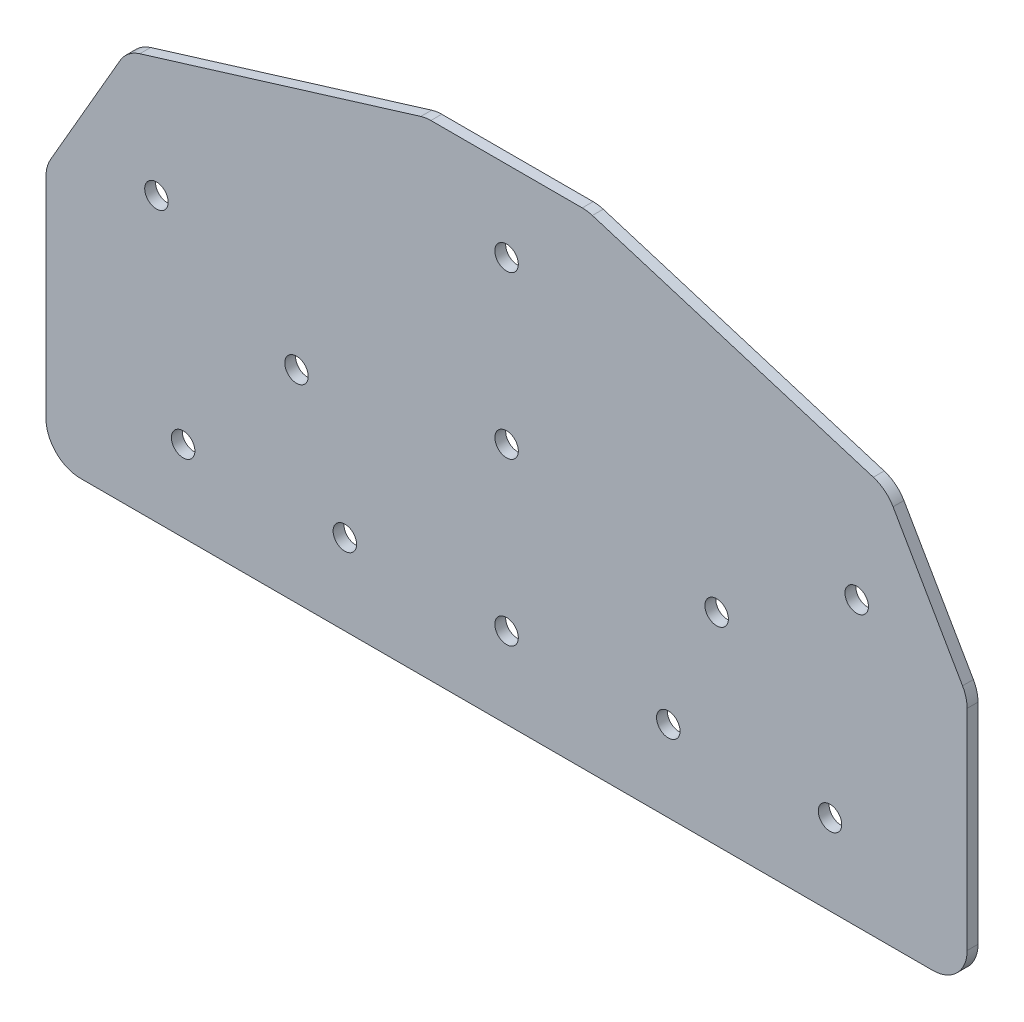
ISO-10303-21;
HEADER;
FILE_DESCRIPTION(('STEP AP214'),'2;1');
FILE_NAME('part.step','',(''),(''),'','','');
FILE_SCHEMA(('AUTOMOTIVE_DESIGN { 1 0 10303 214 1 1 1 1 }'));
ENDSEC;
DATA;
#1=APPLICATION_CONTEXT('core data for automotive mechanical design processes');
#2=APPLICATION_PROTOCOL_DEFINITION('international standard','automotive_design',2000,#1);
#3=PRODUCT_CONTEXT('',#1,'mechanical');
#4=PRODUCT('Part','Part','',(#3));
#5=PRODUCT_RELATED_PRODUCT_CATEGORY('part','',(#4));
#6=PRODUCT_DEFINITION_FORMATION('','',#4);
#7=PRODUCT_DEFINITION_CONTEXT('part definition',#1,'design');
#8=PRODUCT_DEFINITION('design','',#6,#7);
#9=PRODUCT_DEFINITION_SHAPE('','',#8);
#10=(LENGTH_UNIT() NAMED_UNIT(*) SI_UNIT(.MILLI.,.METRE.));
#11=(NAMED_UNIT(*) PLANE_ANGLE_UNIT() SI_UNIT($,.RADIAN.));
#12=(NAMED_UNIT(*) SI_UNIT($,.STERADIAN.) SOLID_ANGLE_UNIT());
#13=UNCERTAINTY_MEASURE_WITH_UNIT(LENGTH_MEASURE(1.E-05),#10,'distance_accuracy_value','');
#14=(GEOMETRIC_REPRESENTATION_CONTEXT(3) GLOBAL_UNCERTAINTY_ASSIGNED_CONTEXT((#13)) GLOBAL_UNIT_ASSIGNED_CONTEXT((#10,
#11,#12)) REPRESENTATION_CONTEXT('',''));
#15=CARTESIAN_POINT('',(0.,0.,0.));
#16=DIRECTION('',(0.,0.,1.));
#17=DIRECTION('',(1.,0.,0.));
#18=AXIS2_PLACEMENT_3D('',#15,#16,#17);
#19=CARTESIAN_POINT('',(56.8325,0.,1.524));
#20=DIRECTION('',(0.,0.,1.));
#21=DIRECTION('',(1.,0.,0.));
#22=AXIS2_PLACEMENT_3D('',#19,#20,#21);
#23=PLANE('',#22);
#24=DIRECTION('',(-1.,0.,0.));
#25=VECTOR('',#24,1.);
#26=CARTESIAN_POINT('',(-56.8325,0.,1.524));
#27=LINE('',#26,#25);
#28=CARTESIAN_POINT('',(-59.9034415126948,0.,1.524));
#29=VERTEX_POINT('',#28);
#30=CARTESIAN_POINT('',(59.9034415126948,0.,1.524));
#31=VERTEX_POINT('',#30);
#32=EDGE_CURVE('E162',#29,#31,#27,.F.);
#33=ORIENTED_EDGE('',*,*,#32,.T.);
#34=CARTESIAN_POINT('',(59.9034415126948,4.841875,1.524));
#35=DIRECTION('',(0.,0.,-1.));
#36=DIRECTION('',(-1.,0.,0.));
#37=AXIS2_PLACEMENT_3D('',#34,#35,#36);
#38=CIRCLE('',#37,4.841875);
#39=CARTESIAN_POINT('',(64.7453165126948,4.841875,1.524));
#40=VERTEX_POINT('',#39);
#41=EDGE_CURVE('E164',#40,#31,#38,.T.);
#42=ORIENTED_EDGE('',*,*,#41,.F.);
#43=DIRECTION('',(0.,1.,0.));
#44=VECTOR('',#43,1.);
#45=CARTESIAN_POINT('',(64.7453165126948,35.6223222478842,1.524));
#46=LINE('',#45,#44);
#47=CARTESIAN_POINT('',(64.7453165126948,34.3249457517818,1.524));
#48=VERTEX_POINT('',#47);
#49=EDGE_CURVE('E158',#48,#40,#46,.F.);
#50=ORIENTED_EDGE('',*,*,#49,.F.);
#51=CARTESIAN_POINT('',(59.9034415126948,34.3249457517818,1.524));
#52=DIRECTION('',(0.,0.,1.));
#53=DIRECTION('',(1.,0.,0.));
#54=AXIS2_PLACEMENT_3D('',#51,#52,#53);
#55=CIRCLE('',#54,4.841875);
#56=CARTESIAN_POINT('',(64.0966282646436,36.7458832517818,1.524));
#57=VERTEX_POINT('',#56);
#58=EDGE_CURVE('E245',#57,#48,#55,.F.);
#59=ORIENTED_EDGE('',*,*,#58,.F.);
#60=DIRECTION('',(0.500000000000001,-0.866025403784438,0.));
#61=VECTOR('',#60,1.);
#62=CARTESIAN_POINT('',(64.7453165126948,35.6223222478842,1.524));
#63=LINE('',#62,#61);
#64=CARTESIAN_POINT('',(54.3310841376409,53.6603018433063,1.524));
#65=VERTEX_POINT('',#64);
#66=EDGE_CURVE('E134',#57,#65,#63,.F.);
#67=ORIENTED_EDGE('',*,*,#66,.T.);
#68=CARTESIAN_POINT('',(50.1378973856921,51.2393643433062,1.524));
#69=DIRECTION('',(0.,0.,-1.));
#70=DIRECTION('',(-1.,0.,0.));
#71=AXIS2_PLACEMENT_3D('',#68,#69,#70);
#72=CIRCLE('',#71,4.841875);
#73=CARTESIAN_POINT('',(51.5580449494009,55.8682880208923,1.524));
#74=VERTEX_POINT('',#73);
#75=EDGE_CURVE('E128',#74,#65,#72,.T.);
#76=ORIENTED_EDGE('',*,*,#75,.F.);
#77=DIRECTION('',(0.956018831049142,-0.293305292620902,0.));
#78=VECTOR('',#77,1.);
#79=CARTESIAN_POINT('',(53.3788165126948,55.3096777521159,1.524));
#80=LINE('',#79,#78);
#81=CARTESIAN_POINT('',(12.0606077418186,67.986048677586,1.524));
#82=VERTEX_POINT('',#81);
#83=EDGE_CURVE('E132',#74,#82,#80,.F.);
#84=ORIENTED_EDGE('',*,*,#83,.T.);
#85=CARTESIAN_POINT('',(10.6404601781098,63.357125,1.524));
#86=DIRECTION('',(0.,0.,-1.));
#87=DIRECTION('',(-1.,0.,0.));
#88=AXIS2_PLACEMENT_3D('',#85,#86,#87);
#89=CIRCLE('',#88,4.841875);
#90=CARTESIAN_POINT('',(10.6404601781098,68.199,1.524));
#91=VERTEX_POINT('',#90);
#92=EDGE_CURVE('E147',#91,#82,#89,.T.);
#93=ORIENTED_EDGE('',*,*,#92,.F.);
#94=DIRECTION('',(1.,0.,0.));
#95=VECTOR('',#94,1.);
#96=CARTESIAN_POINT('',(11.3665,68.199,1.524));
#97=LINE('',#96,#95);
#98=CARTESIAN_POINT('',(-10.6404601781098,68.199,1.524));
#99=VERTEX_POINT('',#98);
#100=EDGE_CURVE('E180',#91,#99,#97,.F.);
#101=ORIENTED_EDGE('',*,*,#100,.T.);
#102=CARTESIAN_POINT('',(-10.6404601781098,63.357125,1.524));
#103=DIRECTION('',(0.,0.,-1.));
#104=DIRECTION('',(-1.,0.,0.));
#105=AXIS2_PLACEMENT_3D('',#102,#103,#104);
#106=CIRCLE('',#105,4.841875);
#107=CARTESIAN_POINT('',(-12.0606077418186,67.986048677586,1.524));
#108=VERTEX_POINT('',#107);
#109=EDGE_CURVE('E182',#108,#99,#106,.T.);
#110=ORIENTED_EDGE('',*,*,#109,.F.);
#111=DIRECTION('',(0.956018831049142,0.293305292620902,0.));
#112=VECTOR('',#111,1.);
#113=CARTESIAN_POINT('',(-53.3788165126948,55.3096777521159,1.524));
#114=LINE('',#113,#112);
#115=CARTESIAN_POINT('',(-51.5580449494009,55.8682880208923,1.524));
#116=VERTEX_POINT('',#115);
#117=EDGE_CURVE('E175',#108,#116,#114,.F.);
#118=ORIENTED_EDGE('',*,*,#117,.T.);
#119=CARTESIAN_POINT('',(-50.1378973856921,51.2393643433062,1.524));
#120=DIRECTION('',(0.,0.,-1.));
#121=DIRECTION('',(-1.,0.,0.));
#122=AXIS2_PLACEMENT_3D('',#119,#120,#121);
#123=CIRCLE('',#122,4.841875);
#124=CARTESIAN_POINT('',(-54.3310841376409,53.6603018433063,1.524));
#125=VERTEX_POINT('',#124);
#126=EDGE_CURVE('E178',#125,#116,#123,.T.);
#127=ORIENTED_EDGE('',*,*,#126,.F.);
#128=DIRECTION('',(0.500000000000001,0.866025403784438,0.));
#129=VECTOR('',#128,1.);
#130=CARTESIAN_POINT('',(-64.7453165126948,35.6223222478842,1.524));
#131=LINE('',#130,#129);
#132=CARTESIAN_POINT('',(-64.0966282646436,36.7458832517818,1.524));
#133=VERTEX_POINT('',#132);
#134=EDGE_CURVE('E170',#125,#133,#131,.F.);
#135=ORIENTED_EDGE('',*,*,#134,.T.);
#136=CARTESIAN_POINT('',(-59.9034415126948,34.3249457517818,1.524));
#137=DIRECTION('',(0.,0.,1.));
#138=DIRECTION('',(1.,0.,0.));
#139=AXIS2_PLACEMENT_3D('',#136,#137,#138);
#140=CIRCLE('',#139,4.841875);
#141=CARTESIAN_POINT('',(-64.7453165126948,34.3249457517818,1.524));
#142=VERTEX_POINT('',#141);
#143=EDGE_CURVE('E173',#142,#133,#140,.F.);
#144=ORIENTED_EDGE('',*,*,#143,.F.);
#145=DIRECTION('',(0.,1.,0.));
#146=VECTOR('',#145,1.);
#147=CARTESIAN_POINT('',(-64.7453165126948,35.6223222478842,1.524));
#148=LINE('',#147,#146);
#149=CARTESIAN_POINT('',(-64.7453165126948,4.84187499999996,1.524));
#150=VERTEX_POINT('',#149);
#151=EDGE_CURVE('E166',#150,#142,#148,.T.);
#152=ORIENTED_EDGE('',*,*,#151,.F.);
#153=CARTESIAN_POINT('',(-59.9034415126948,4.84187499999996,1.524));
#154=DIRECTION('',(0.,0.,-1.));
#155=DIRECTION('',(-1.,0.,0.));
#156=AXIS2_PLACEMENT_3D('',#153,#154,#155);
#157=CIRCLE('',#156,4.841875);
#158=EDGE_CURVE('E249',#29,#150,#157,.T.);
#159=ORIENTED_EDGE('',*,*,#158,.F.);
#160=EDGE_LOOP('',(#33,#42,#50,#59,#67,#76,#84,#93,#101,#110,#118,#127,#135,#144,#152,#159));
#161=FACE_BOUND('',#160,.T.);
#162=CARTESIAN_POINT('',(22.733,11.3665,1.524));
#163=DIRECTION('',(0.,0.,1.));
#164=DIRECTION('',(1.,0.,0.));
#165=AXIS2_PLACEMENT_3D('',#162,#163,#164);
#166=CIRCLE('',#165,1.651);
#167=CARTESIAN_POINT('',(24.384,11.3665,1.524));
#168=VERTEX_POINT('',#167);
#169=EDGE_CURVE('E140',#168,#168,#166,.F.);
#170=ORIENTED_EDGE('',*,*,#169,.T.);
#171=EDGE_LOOP('',(#170));
#172=FACE_BOUND('',#171,.T.);
#173=CARTESIAN_POINT('',(-22.733,11.3665,1.524));
#174=DIRECTION('',(0.,0.,1.));
#175=DIRECTION('',(1.,0.,0.));
#176=AXIS2_PLACEMENT_3D('',#173,#174,#175);
#177=CIRCLE('',#176,1.651);
#178=CARTESIAN_POINT('',(-21.082,11.3665,1.524));
#179=VERTEX_POINT('',#178);
#180=EDGE_CURVE('E260',#179,#179,#177,.F.);
#181=ORIENTED_EDGE('',*,*,#180,.T.);
#182=EDGE_LOOP('',(#181));
#183=FACE_BOUND('',#182,.T.);
#184=CARTESIAN_POINT('',(-29.5310332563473,28.41625,1.524));
#185=DIRECTION('',(0.,0.,1.));
#186=DIRECTION('',(1.,0.,0.));
#187=AXIS2_PLACEMENT_3D('',#184,#185,#186);
#188=CIRCLE('',#187,1.651);
#189=CARTESIAN_POINT('',(-27.8800332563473,28.41625,1.524));
#190=VERTEX_POINT('',#189);
#191=EDGE_CURVE('E263',#190,#190,#188,.F.);
#192=ORIENTED_EDGE('',*,*,#191,.T.);
#193=EDGE_LOOP('',(#192));
#194=FACE_BOUND('',#193,.T.);
#195=CARTESIAN_POINT('',(-49.218388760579,39.78275,1.524));
#196=DIRECTION('',(0.,0.,1.));
#197=DIRECTION('',(1.,0.,0.));
#198=AXIS2_PLACEMENT_3D('',#195,#196,#197);
#199=CIRCLE('',#198,1.651);
#200=CARTESIAN_POINT('',(-47.567388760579,39.78275,1.524));
#201=VERTEX_POINT('',#200);
#202=EDGE_CURVE('E266',#201,#201,#199,.F.);
#203=ORIENTED_EDGE('',*,*,#202,.T.);
#204=EDGE_LOOP('',(#203));
#205=FACE_BOUND('',#204,.T.);
#206=CARTESIAN_POINT('',(29.5310332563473,28.41625,1.524));
#207=DIRECTION('',(0.,0.,1.));
#208=DIRECTION('',(1.,0.,0.));
#209=AXIS2_PLACEMENT_3D('',#206,#207,#208);
#210=CIRCLE('',#209,1.651);
#211=CARTESIAN_POINT('',(31.1820332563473,28.41625,1.524));
#212=VERTEX_POINT('',#211);
#213=EDGE_CURVE('E269',#212,#212,#210,.F.);
#214=ORIENTED_EDGE('',*,*,#213,.T.);
#215=EDGE_LOOP('',(#214));
#216=FACE_BOUND('',#215,.T.);
#217=CARTESIAN_POINT('',(49.2183887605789,39.78275,1.524));
#218=DIRECTION('',(0.,0.,1.));
#219=DIRECTION('',(1.,0.,0.));
#220=AXIS2_PLACEMENT_3D('',#217,#218,#219);
#221=CIRCLE('',#220,1.651);
#222=CARTESIAN_POINT('',(50.8693887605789,39.78275,1.524));
#223=VERTEX_POINT('',#222);
#224=EDGE_CURVE('E272',#223,#223,#221,.F.);
#225=ORIENTED_EDGE('',*,*,#224,.T.);
#226=EDGE_LOOP('',(#225));
#227=FACE_BOUND('',#226,.T.);
#228=CARTESIAN_POINT('',(45.466,11.3665,1.524));
#229=DIRECTION('',(0.,0.,1.));
#230=DIRECTION('',(1.,0.,0.));
#231=AXIS2_PLACEMENT_3D('',#228,#229,#230);
#232=CIRCLE('',#231,1.651);
#233=CARTESIAN_POINT('',(47.117,11.3665,1.524));
#234=VERTEX_POINT('',#233);
#235=EDGE_CURVE('E275',#234,#234,#232,.F.);
#236=ORIENTED_EDGE('',*,*,#235,.T.);
#237=EDGE_LOOP('',(#236));
#238=FACE_BOUND('',#237,.T.);
#239=CARTESIAN_POINT('',(-45.466,11.3665,1.524));
#240=DIRECTION('',(0.,0.,1.));
#241=DIRECTION('',(1.,0.,0.));
#242=AXIS2_PLACEMENT_3D('',#239,#240,#241);
#243=CIRCLE('',#242,1.651);
#244=CARTESIAN_POINT('',(-43.815,11.3665,1.524));
#245=VERTEX_POINT('',#244);
#246=EDGE_CURVE('E278',#245,#245,#243,.F.);
#247=ORIENTED_EDGE('',*,*,#246,.T.);
#248=EDGE_LOOP('',(#247));
#249=FACE_BOUND('',#248,.T.);
#250=CARTESIAN_POINT('',(0.,34.0995,1.524));
#251=DIRECTION('',(0.,0.,1.));
#252=DIRECTION('',(1.,0.,0.));
#253=AXIS2_PLACEMENT_3D('',#250,#251,#252);
#254=CIRCLE('',#253,1.651);
#255=CARTESIAN_POINT('',(1.65100000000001,34.0995,1.524));
#256=VERTEX_POINT('',#255);
#257=EDGE_CURVE('E281',#256,#256,#254,.F.);
#258=ORIENTED_EDGE('',*,*,#257,.T.);
#259=EDGE_LOOP('',(#258));
#260=FACE_BOUND('',#259,.T.);
#261=CARTESIAN_POINT('',(0.,56.8325,1.524));
#262=DIRECTION('',(0.,0.,1.));
#263=DIRECTION('',(1.,0.,0.));
#264=AXIS2_PLACEMENT_3D('',#261,#262,#263);
#265=CIRCLE('',#264,1.651);
#266=CARTESIAN_POINT('',(1.65100000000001,56.8325,1.524));
#267=VERTEX_POINT('',#266);
#268=EDGE_CURVE('E283',#267,#267,#265,.F.);
#269=ORIENTED_EDGE('',*,*,#268,.T.);
#270=EDGE_LOOP('',(#269));
#271=FACE_BOUND('',#270,.T.);
#272=CARTESIAN_POINT('',(0.,11.3665,1.524));
#273=DIRECTION('',(0.,0.,1.));
#274=DIRECTION('',(1.,0.,0.));
#275=AXIS2_PLACEMENT_3D('',#272,#273,#274);
#276=CIRCLE('',#275,1.651);
#277=CARTESIAN_POINT('',(1.65100000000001,11.3665,1.524));
#278=VERTEX_POINT('',#277);
#279=EDGE_CURVE('E20',#278,#278,#276,.F.);
#280=ORIENTED_EDGE('',*,*,#279,.T.);
#281=EDGE_LOOP('',(#280));
#282=FACE_BOUND('',#281,.T.);
#283=ADVANCED_FACE('F17',(#161,#172,#183,#194,#205,#216,#227,#238,#249,#260,#271,#282),#23,.T.);
#284=CARTESIAN_POINT('',(0.,11.3665,1.524));
#285=DIRECTION('',(0.,0.,1.));
#286=DIRECTION('',(1.,0.,0.));
#287=AXIS2_PLACEMENT_3D('',#284,#285,#286);
#288=CYLINDRICAL_SURFACE('',#287,1.651);
#289=CARTESIAN_POINT('',(0.,11.3665,0.));
#290=DIRECTION('',(0.,0.,1.));
#291=DIRECTION('',(1.,0.,0.));
#292=AXIS2_PLACEMENT_3D('',#289,#290,#291);
#293=CIRCLE('',#292,1.651);
#294=CARTESIAN_POINT('',(1.65100000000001,11.3665,0.));
#295=VERTEX_POINT('',#294);
#296=EDGE_CURVE('E157',#295,#295,#293,.F.);
#297=ORIENTED_EDGE('',*,*,#296,.T.);
#298=EDGE_LOOP('',(#297));
#299=FACE_BOUND('',#298,.T.);
#300=ORIENTED_EDGE('',*,*,#279,.F.);
#301=EDGE_LOOP('',(#300));
#302=FACE_BOUND('',#301,.T.);
#303=ADVANCED_FACE('F291',(#299,#302),#288,.F.);
#304=CARTESIAN_POINT('',(0.,56.8325,1.524));
#305=DIRECTION('',(0.,0.,1.));
#306=DIRECTION('',(1.,0.,0.));
#307=AXIS2_PLACEMENT_3D('',#304,#305,#306);
#308=CYLINDRICAL_SURFACE('',#307,1.651);
#309=CARTESIAN_POINT('',(0.,56.8325,0.));
#310=DIRECTION('',(0.,0.,1.));
#311=DIRECTION('',(1.,0.,0.));
#312=AXIS2_PLACEMENT_3D('',#309,#310,#311);
#313=CIRCLE('',#312,1.651);
#314=CARTESIAN_POINT('',(1.65100000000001,56.8325,0.));
#315=VERTEX_POINT('',#314);
#316=EDGE_CURVE('E240',#315,#315,#313,.F.);
#317=ORIENTED_EDGE('',*,*,#316,.T.);
#318=EDGE_LOOP('',(#317));
#319=FACE_BOUND('',#318,.T.);
#320=ORIENTED_EDGE('',*,*,#268,.F.);
#321=EDGE_LOOP('',(#320));
#322=FACE_BOUND('',#321,.T.);
#323=ADVANCED_FACE('F293',(#319,#322),#308,.F.);
#324=CARTESIAN_POINT('',(0.,34.0995,1.524));
#325=DIRECTION('',(0.,0.,1.));
#326=DIRECTION('',(1.,0.,0.));
#327=AXIS2_PLACEMENT_3D('',#324,#325,#326);
#328=CYLINDRICAL_SURFACE('',#327,1.651);
#329=CARTESIAN_POINT('',(0.,34.0995,0.));
#330=DIRECTION('',(0.,0.,1.));
#331=DIRECTION('',(1.,0.,0.));
#332=AXIS2_PLACEMENT_3D('',#329,#330,#331);
#333=CIRCLE('',#332,1.651);
#334=CARTESIAN_POINT('',(1.65100000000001,34.0995,0.));
#335=VERTEX_POINT('',#334);
#336=EDGE_CURVE('E237',#335,#335,#333,.F.);
#337=ORIENTED_EDGE('',*,*,#336,.T.);
#338=EDGE_LOOP('',(#337));
#339=FACE_BOUND('',#338,.T.);
#340=ORIENTED_EDGE('',*,*,#257,.F.);
#341=EDGE_LOOP('',(#340));
#342=FACE_BOUND('',#341,.T.);
#343=ADVANCED_FACE('F300',(#339,#342),#328,.F.);
#344=CARTESIAN_POINT('',(-45.466,11.3665,1.524));
#345=DIRECTION('',(0.,0.,1.));
#346=DIRECTION('',(1.,0.,0.));
#347=AXIS2_PLACEMENT_3D('',#344,#345,#346);
#348=CYLINDRICAL_SURFACE('',#347,1.651);
#349=CARTESIAN_POINT('',(-45.466,11.3665,0.));
#350=DIRECTION('',(0.,0.,1.));
#351=DIRECTION('',(1.,0.,0.));
#352=AXIS2_PLACEMENT_3D('',#349,#350,#351);
#353=CIRCLE('',#352,1.651);
#354=CARTESIAN_POINT('',(-43.815,11.3665,0.));
#355=VERTEX_POINT('',#354);
#356=EDGE_CURVE('E234',#355,#355,#353,.F.);
#357=ORIENTED_EDGE('',*,*,#356,.T.);
#358=EDGE_LOOP('',(#357));
#359=FACE_BOUND('',#358,.T.);
#360=ORIENTED_EDGE('',*,*,#246,.F.);
#361=EDGE_LOOP('',(#360));
#362=FACE_BOUND('',#361,.T.);
#363=ADVANCED_FACE('F398',(#359,#362),#348,.F.);
#364=CARTESIAN_POINT('',(45.466,11.3665,1.524));
#365=DIRECTION('',(0.,0.,1.));
#366=DIRECTION('',(1.,0.,0.));
#367=AXIS2_PLACEMENT_3D('',#364,#365,#366);
#368=CYLINDRICAL_SURFACE('',#367,1.651);
#369=CARTESIAN_POINT('',(45.466,11.3665,0.));
#370=DIRECTION('',(0.,0.,1.));
#371=DIRECTION('',(1.,0.,0.));
#372=AXIS2_PLACEMENT_3D('',#369,#370,#371);
#373=CIRCLE('',#372,1.651);
#374=CARTESIAN_POINT('',(47.117,11.3665,0.));
#375=VERTEX_POINT('',#374);
#376=EDGE_CURVE('E231',#375,#375,#373,.F.);
#377=ORIENTED_EDGE('',*,*,#376,.T.);
#378=EDGE_LOOP('',(#377));
#379=FACE_BOUND('',#378,.T.);
#380=ORIENTED_EDGE('',*,*,#235,.F.);
#381=EDGE_LOOP('',(#380));
#382=FACE_BOUND('',#381,.T.);
#383=ADVANCED_FACE('F394',(#379,#382),#368,.F.);
#384=CARTESIAN_POINT('',(49.2183887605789,39.78275,1.524));
#385=DIRECTION('',(0.,0.,1.));
#386=DIRECTION('',(1.,0.,0.));
#387=AXIS2_PLACEMENT_3D('',#384,#385,#386);
#388=CYLINDRICAL_SURFACE('',#387,1.651);
#389=CARTESIAN_POINT('',(49.2183887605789,39.78275,0.));
#390=DIRECTION('',(0.,0.,1.));
#391=DIRECTION('',(1.,0.,0.));
#392=AXIS2_PLACEMENT_3D('',#389,#390,#391);
#393=CIRCLE('',#392,1.651);
#394=CARTESIAN_POINT('',(50.8693887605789,39.78275,0.));
#395=VERTEX_POINT('',#394);
#396=EDGE_CURVE('E228',#395,#395,#393,.F.);
#397=ORIENTED_EDGE('',*,*,#396,.T.);
#398=EDGE_LOOP('',(#397));
#399=FACE_BOUND('',#398,.T.);
#400=ORIENTED_EDGE('',*,*,#224,.F.);
#401=EDGE_LOOP('',(#400));
#402=FACE_BOUND('',#401,.T.);
#403=ADVANCED_FACE('F390',(#399,#402),#388,.F.);
#404=CARTESIAN_POINT('',(29.5310332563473,28.41625,1.524));
#405=DIRECTION('',(0.,0.,1.));
#406=DIRECTION('',(1.,0.,0.));
#407=AXIS2_PLACEMENT_3D('',#404,#405,#406);
#408=CYLINDRICAL_SURFACE('',#407,1.651);
#409=CARTESIAN_POINT('',(29.5310332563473,28.41625,0.));
#410=DIRECTION('',(0.,0.,1.));
#411=DIRECTION('',(1.,0.,0.));
#412=AXIS2_PLACEMENT_3D('',#409,#410,#411);
#413=CIRCLE('',#412,1.651);
#414=CARTESIAN_POINT('',(31.1820332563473,28.41625,0.));
#415=VERTEX_POINT('',#414);
#416=EDGE_CURVE('E225',#415,#415,#413,.F.);
#417=ORIENTED_EDGE('',*,*,#416,.T.);
#418=EDGE_LOOP('',(#417));
#419=FACE_BOUND('',#418,.T.);
#420=ORIENTED_EDGE('',*,*,#213,.F.);
#421=EDGE_LOOP('',(#420));
#422=FACE_BOUND('',#421,.T.);
#423=ADVANCED_FACE('F386',(#419,#422),#408,.F.);
#424=CARTESIAN_POINT('',(-49.218388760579,39.78275,1.524));
#425=DIRECTION('',(0.,0.,1.));
#426=DIRECTION('',(1.,0.,0.));
#427=AXIS2_PLACEMENT_3D('',#424,#425,#426);
#428=CYLINDRICAL_SURFACE('',#427,1.651);
#429=CARTESIAN_POINT('',(-49.218388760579,39.78275,0.));
#430=DIRECTION('',(0.,0.,1.));
#431=DIRECTION('',(1.,0.,0.));
#432=AXIS2_PLACEMENT_3D('',#429,#430,#431);
#433=CIRCLE('',#432,1.651);
#434=CARTESIAN_POINT('',(-47.567388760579,39.78275,0.));
#435=VERTEX_POINT('',#434);
#436=EDGE_CURVE('E222',#435,#435,#433,.F.);
#437=ORIENTED_EDGE('',*,*,#436,.T.);
#438=EDGE_LOOP('',(#437));
#439=FACE_BOUND('',#438,.T.);
#440=ORIENTED_EDGE('',*,*,#202,.F.);
#441=EDGE_LOOP('',(#440));
#442=FACE_BOUND('',#441,.T.);
#443=ADVANCED_FACE('F382',(#439,#442),#428,.F.);
#444=CARTESIAN_POINT('',(-29.5310332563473,28.41625,1.524));
#445=DIRECTION('',(0.,0.,1.));
#446=DIRECTION('',(1.,0.,0.));
#447=AXIS2_PLACEMENT_3D('',#444,#445,#446);
#448=CYLINDRICAL_SURFACE('',#447,1.651);
#449=CARTESIAN_POINT('',(-29.5310332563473,28.41625,0.));
#450=DIRECTION('',(0.,0.,1.));
#451=DIRECTION('',(1.,0.,0.));
#452=AXIS2_PLACEMENT_3D('',#449,#450,#451);
#453=CIRCLE('',#452,1.651);
#454=CARTESIAN_POINT('',(-27.8800332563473,28.41625,0.));
#455=VERTEX_POINT('',#454);
#456=EDGE_CURVE('E219',#455,#455,#453,.F.);
#457=ORIENTED_EDGE('',*,*,#456,.T.);
#458=EDGE_LOOP('',(#457));
#459=FACE_BOUND('',#458,.T.);
#460=ORIENTED_EDGE('',*,*,#191,.F.);
#461=EDGE_LOOP('',(#460));
#462=FACE_BOUND('',#461,.T.);
#463=ADVANCED_FACE('F378',(#459,#462),#448,.F.);
#464=CARTESIAN_POINT('',(-22.733,11.3665,1.524));
#465=DIRECTION('',(0.,0.,1.));
#466=DIRECTION('',(1.,0.,0.));
#467=AXIS2_PLACEMENT_3D('',#464,#465,#466);
#468=CYLINDRICAL_SURFACE('',#467,1.651);
#469=CARTESIAN_POINT('',(-22.733,11.3665,0.));
#470=DIRECTION('',(0.,0.,1.));
#471=DIRECTION('',(1.,0.,0.));
#472=AXIS2_PLACEMENT_3D('',#469,#470,#471);
#473=CIRCLE('',#472,1.651);
#474=CARTESIAN_POINT('',(-21.082,11.3665,0.));
#475=VERTEX_POINT('',#474);
#476=EDGE_CURVE('E216',#475,#475,#473,.F.);
#477=ORIENTED_EDGE('',*,*,#476,.T.);
#478=EDGE_LOOP('',(#477));
#479=FACE_BOUND('',#478,.T.);
#480=ORIENTED_EDGE('',*,*,#180,.F.);
#481=EDGE_LOOP('',(#480));
#482=FACE_BOUND('',#481,.T.);
#483=ADVANCED_FACE('F374',(#479,#482),#468,.F.);
#484=CARTESIAN_POINT('',(22.733,11.3665,1.524));
#485=DIRECTION('',(0.,0.,1.));
#486=DIRECTION('',(1.,0.,0.));
#487=AXIS2_PLACEMENT_3D('',#484,#485,#486);
#488=CYLINDRICAL_SURFACE('',#487,1.651);
#489=CARTESIAN_POINT('',(22.733,11.3665,0.));
#490=DIRECTION('',(0.,0.,1.));
#491=DIRECTION('',(1.,0.,0.));
#492=AXIS2_PLACEMENT_3D('',#489,#490,#491);
#493=CIRCLE('',#492,1.651);
#494=CARTESIAN_POINT('',(24.384,11.3665,0.));
#495=VERTEX_POINT('',#494);
#496=EDGE_CURVE('E213',#495,#495,#493,.F.);
#497=ORIENTED_EDGE('',*,*,#496,.T.);
#498=EDGE_LOOP('',(#497));
#499=FACE_BOUND('',#498,.T.);
#500=ORIENTED_EDGE('',*,*,#169,.F.);
#501=EDGE_LOOP('',(#500));
#502=FACE_BOUND('',#501,.T.);
#503=ADVANCED_FACE('F371',(#499,#502),#488,.F.);
#504=CARTESIAN_POINT('',(50.1378973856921,51.2393643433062,1.524));
#505=DIRECTION('',(0.,0.,-1.));
#506=DIRECTION('',(-1.,0.,0.));
#507=AXIS2_PLACEMENT_3D('',#504,#505,#506);
#508=CYLINDRICAL_SURFACE('',#507,4.841875);
#509=CARTESIAN_POINT('',(50.1378973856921,51.2393643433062,0.));
#510=DIRECTION('',(0.,0.,-1.));
#511=DIRECTION('',(-1.,0.,0.));
#512=AXIS2_PLACEMENT_3D('',#509,#510,#511);
#513=CIRCLE('',#512,4.841875);
#514=CARTESIAN_POINT('',(54.3310841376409,53.6603018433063,0.));
#515=VERTEX_POINT('',#514);
#516=CARTESIAN_POINT('',(51.5580449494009,55.8682880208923,0.));
#517=VERTEX_POINT('',#516);
#518=EDGE_CURVE('E151',#515,#517,#513,.F.);
#519=ORIENTED_EDGE('',*,*,#518,.T.);
#520=DIRECTION('',(0.,0.,1.));
#521=VECTOR('',#520,1.);
#522=CARTESIAN_POINT('',(51.5580449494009,55.8682880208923,1.524));
#523=LINE('',#522,#521);
#524=EDGE_CURVE('E139',#517,#74,#523,.T.);
#525=ORIENTED_EDGE('',*,*,#524,.T.);
#526=ORIENTED_EDGE('',*,*,#75,.T.);
#527=DIRECTION('',(0.,0.,1.));
#528=VECTOR('',#527,1.);
#529=CARTESIAN_POINT('',(54.3310841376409,53.6603018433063,1.524));
#530=LINE('',#529,#528);
#531=EDGE_CURVE('E643',#65,#515,#530,.F.);
#532=ORIENTED_EDGE('',*,*,#531,.T.);
#533=EDGE_LOOP('',(#519,#525,#526,#532));
#534=FACE_BOUND('',#533,.T.);
#535=ADVANCED_FACE('F150',(#534),#508,.T.);
#536=CARTESIAN_POINT('',(53.3788165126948,55.3096777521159,1.524));
#537=DIRECTION('',(-0.293305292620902,-0.956018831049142,0.));
#538=DIRECTION('',(0.956018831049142,-0.293305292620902,0.));
#539=AXIS2_PLACEMENT_3D('',#536,#537,#538);
#540=PLANE('',#539);
#541=ORIENTED_EDGE('',*,*,#524,.F.);
#542=DIRECTION('',(-0.956018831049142,0.293305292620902,0.));
#543=VECTOR('',#542,1.);
#544=CARTESIAN_POINT('',(51.5580449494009,55.8682880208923,0.));
#545=LINE('',#544,#543);
#546=CARTESIAN_POINT('',(12.0606077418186,67.986048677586,0.));
#547=VERTEX_POINT('',#546);
#548=EDGE_CURVE('E211',#517,#547,#545,.T.);
#549=ORIENTED_EDGE('',*,*,#548,.T.);
#550=DIRECTION('',(0.,0.,-1.));
#551=VECTOR('',#550,1.);
#552=CARTESIAN_POINT('',(12.0606077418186,67.986048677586,1.524));
#553=LINE('',#552,#551);
#554=EDGE_CURVE('E146',#82,#547,#553,.T.);
#555=ORIENTED_EDGE('',*,*,#554,.F.);
#556=ORIENTED_EDGE('',*,*,#83,.F.);
#557=EDGE_LOOP('',(#541,#549,#555,#556));
#558=FACE_BOUND('',#557,.T.);
#559=ADVANCED_FACE('F143',(#558),#540,.F.);
#560=CARTESIAN_POINT('',(10.6404601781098,63.357125,1.524));
#561=DIRECTION('',(0.,0.,-1.));
#562=DIRECTION('',(-1.,0.,0.));
#563=AXIS2_PLACEMENT_3D('',#560,#561,#562);
#564=CYLINDRICAL_SURFACE('',#563,4.841875);
#565=CARTESIAN_POINT('',(10.6404601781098,63.357125,0.));
#566=DIRECTION('',(0.,0.,-1.));
#567=DIRECTION('',(-1.,0.,0.));
#568=AXIS2_PLACEMENT_3D('',#565,#566,#567);
#569=CIRCLE('',#568,4.841875);
#570=CARTESIAN_POINT('',(10.6404601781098,68.199,0.));
#571=VERTEX_POINT('',#570);
#572=EDGE_CURVE('E208',#547,#571,#569,.F.);
#573=ORIENTED_EDGE('',*,*,#572,.T.);
#574=DIRECTION('',(0.,0.,-1.));
#575=VECTOR('',#574,1.);
#576=CARTESIAN_POINT('',(10.6404601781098,68.199,1.524));
#577=LINE('',#576,#575);
#578=EDGE_CURVE('E183',#571,#91,#577,.F.);
#579=ORIENTED_EDGE('',*,*,#578,.T.);
#580=ORIENTED_EDGE('',*,*,#92,.T.);
#581=ORIENTED_EDGE('',*,*,#554,.T.);
#582=EDGE_LOOP('',(#573,#579,#580,#581));
#583=FACE_BOUND('',#582,.T.);
#584=ADVANCED_FACE('F362',(#583),#564,.T.);
#585=CARTESIAN_POINT('',(11.3665,68.199,1.524));
#586=DIRECTION('',(0.,-1.,0.));
#587=DIRECTION('',(0.,0.,-1.));
#588=AXIS2_PLACEMENT_3D('',#585,#586,#587);
#589=PLANE('',#588);
#590=ORIENTED_EDGE('',*,*,#578,.F.);
#591=DIRECTION('',(1.,0.,0.));
#592=VECTOR('',#591,1.);
#593=CARTESIAN_POINT('',(56.8325,68.199,0.));
#594=LINE('',#593,#592);
#595=CARTESIAN_POINT('',(-10.6404601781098,68.199,0.));
#596=VERTEX_POINT('',#595);
#597=EDGE_CURVE('E207',#571,#596,#594,.F.);
#598=ORIENTED_EDGE('',*,*,#597,.T.);
#599=DIRECTION('',(0.,0.,-1.));
#600=VECTOR('',#599,1.);
#601=CARTESIAN_POINT('',(-10.6404601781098,68.199,1.524));
#602=LINE('',#601,#600);
#603=EDGE_CURVE('E256',#99,#596,#602,.T.);
#604=ORIENTED_EDGE('',*,*,#603,.F.);
#605=ORIENTED_EDGE('',*,*,#100,.F.);
#606=EDGE_LOOP('',(#590,#598,#604,#605));
#607=FACE_BOUND('',#606,.T.);
#608=ADVANCED_FACE('F358',(#607),#589,.F.);
#609=CARTESIAN_POINT('',(-10.6404601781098,63.357125,1.524));
#610=DIRECTION('',(0.,0.,-1.));
#611=DIRECTION('',(-1.,0.,0.));
#612=AXIS2_PLACEMENT_3D('',#609,#610,#611);
#613=CYLINDRICAL_SURFACE('',#612,4.841875);
#614=CARTESIAN_POINT('',(-10.6404601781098,63.357125,0.));
#615=DIRECTION('',(0.,0.,-1.));
#616=DIRECTION('',(-1.,0.,0.));
#617=AXIS2_PLACEMENT_3D('',#614,#615,#616);
#618=CIRCLE('',#617,4.841875);
#619=CARTESIAN_POINT('',(-12.0606077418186,67.986048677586,0.));
#620=VERTEX_POINT('',#619);
#621=EDGE_CURVE('E204',#596,#620,#618,.F.);
#622=ORIENTED_EDGE('',*,*,#621,.T.);
#623=DIRECTION('',(0.,0.,1.));
#624=VECTOR('',#623,1.);
#625=CARTESIAN_POINT('',(-12.0606077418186,67.986048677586,1.524));
#626=LINE('',#625,#624);
#627=EDGE_CURVE('E179',#620,#108,#626,.T.);
#628=ORIENTED_EDGE('',*,*,#627,.T.);
#629=ORIENTED_EDGE('',*,*,#109,.T.);
#630=ORIENTED_EDGE('',*,*,#603,.T.);
#631=EDGE_LOOP('',(#622,#628,#629,#630));
#632=FACE_BOUND('',#631,.T.);
#633=ADVANCED_FACE('F354',(#632),#613,.T.);
#634=CARTESIAN_POINT('',(-53.3788165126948,55.3096777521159,1.524));
#635=DIRECTION('',(0.293305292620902,-0.956018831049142,0.));
#636=DIRECTION('',(0.956018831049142,0.293305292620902,0.));
#637=AXIS2_PLACEMENT_3D('',#634,#635,#636);
#638=PLANE('',#637);
#639=ORIENTED_EDGE('',*,*,#627,.F.);
#640=DIRECTION('',(-0.956018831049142,-0.293305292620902,0.));
#641=VECTOR('',#640,1.);
#642=CARTESIAN_POINT('',(-12.0606077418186,67.986048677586,0.));
#643=LINE('',#642,#641);
#644=CARTESIAN_POINT('',(-51.5580449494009,55.8682880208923,0.));
#645=VERTEX_POINT('',#644);
#646=EDGE_CURVE('E203',#620,#645,#643,.T.);
#647=ORIENTED_EDGE('',*,*,#646,.T.);
#648=DIRECTION('',(0.,0.,-1.));
#649=VECTOR('',#648,1.);
#650=CARTESIAN_POINT('',(-51.5580449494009,55.8682880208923,1.524));
#651=LINE('',#650,#649);
#652=EDGE_CURVE('E254',#116,#645,#651,.T.);
#653=ORIENTED_EDGE('',*,*,#652,.F.);
#654=ORIENTED_EDGE('',*,*,#117,.F.);
#655=EDGE_LOOP('',(#639,#647,#653,#654));
#656=FACE_BOUND('',#655,.T.);
#657=ADVANCED_FACE('F350',(#656),#638,.F.);
#658=CARTESIAN_POINT('',(-50.1378973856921,51.2393643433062,1.524));
#659=DIRECTION('',(0.,0.,-1.));
#660=DIRECTION('',(-1.,0.,0.));
#661=AXIS2_PLACEMENT_3D('',#658,#659,#660);
#662=CYLINDRICAL_SURFACE('',#661,4.841875);
#663=CARTESIAN_POINT('',(-50.1378973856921,51.2393643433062,0.));
#664=DIRECTION('',(0.,0.,-1.));
#665=DIRECTION('',(-1.,0.,0.));
#666=AXIS2_PLACEMENT_3D('',#663,#664,#665);
#667=CIRCLE('',#666,4.841875);
#668=CARTESIAN_POINT('',(-54.3310841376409,53.6603018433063,0.));
#669=VERTEX_POINT('',#668);
#670=EDGE_CURVE('E200',#645,#669,#667,.F.);
#671=ORIENTED_EDGE('',*,*,#670,.T.);
#672=DIRECTION('',(0.,0.,1.));
#673=VECTOR('',#672,1.);
#674=CARTESIAN_POINT('',(-54.3310841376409,53.6603018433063,1.524));
#675=LINE('',#674,#673);
#676=EDGE_CURVE('E174',#669,#125,#675,.T.);
#677=ORIENTED_EDGE('',*,*,#676,.T.);
#678=ORIENTED_EDGE('',*,*,#126,.T.);
#679=ORIENTED_EDGE('',*,*,#652,.T.);
#680=EDGE_LOOP('',(#671,#677,#678,#679));
#681=FACE_BOUND('',#680,.T.);
#682=ADVANCED_FACE('F346',(#681),#662,.T.);
#683=CARTESIAN_POINT('',(-64.7453165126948,35.6223222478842,1.524));
#684=DIRECTION('',(0.866025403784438,-0.500000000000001,0.));
#685=DIRECTION('',(0.500000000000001,0.866025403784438,0.));
#686=AXIS2_PLACEMENT_3D('',#683,#684,#685);
#687=PLANE('',#686);
#688=DIRECTION('',(0.,0.,1.));
#689=VECTOR('',#688,1.);
#690=CARTESIAN_POINT('',(-64.0966282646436,36.7458832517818,-36.4905810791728));
#691=LINE('',#690,#689);
#692=CARTESIAN_POINT('',(-64.0966282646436,36.7458832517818,0.));
#693=VERTEX_POINT('',#692);
#694=EDGE_CURVE('E169',#133,#693,#691,.F.);
#695=ORIENTED_EDGE('',*,*,#694,.F.);
#696=ORIENTED_EDGE('',*,*,#134,.F.);
#697=ORIENTED_EDGE('',*,*,#676,.F.);
#698=DIRECTION('',(-0.500000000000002,-0.866025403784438,0.));
#699=VECTOR('',#698,1.);
#700=CARTESIAN_POINT('',(-54.3310841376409,53.6603018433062,0.));
#701=LINE('',#700,#699);
#702=EDGE_CURVE('E199',#669,#693,#701,.T.);
#703=ORIENTED_EDGE('',*,*,#702,.T.);
#704=EDGE_LOOP('',(#695,#696,#697,#703));
#705=FACE_BOUND('',#704,.T.);
#706=ADVANCED_FACE('F342',(#705),#687,.F.);
#707=CARTESIAN_POINT('',(-59.9034415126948,34.3249457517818,-36.4905810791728));
#708=DIRECTION('',(0.,0.,1.));
#709=DIRECTION('',(1.,0.,0.));
#710=AXIS2_PLACEMENT_3D('',#707,#708,#709);
#711=CYLINDRICAL_SURFACE('',#710,4.841875);
#712=CARTESIAN_POINT('',(-59.9034415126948,34.3249457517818,0.));
#713=DIRECTION('',(0.,0.,1.));
#714=DIRECTION('',(1.,0.,0.));
#715=AXIS2_PLACEMENT_3D('',#712,#713,#714);
#716=CIRCLE('',#715,4.841875);
#717=CARTESIAN_POINT('',(-64.7453165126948,34.3249457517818,0.));
#718=VERTEX_POINT('',#717);
#719=EDGE_CURVE('E196',#693,#718,#716,.T.);
#720=ORIENTED_EDGE('',*,*,#719,.T.);
#721=DIRECTION('',(0.,0.,1.));
#722=VECTOR('',#721,1.);
#723=CARTESIAN_POINT('',(-64.7453165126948,34.3249457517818,-36.4905810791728));
#724=LINE('',#723,#722);
#725=EDGE_CURVE('E168',#142,#718,#724,.F.);
#726=ORIENTED_EDGE('',*,*,#725,.F.);
#727=ORIENTED_EDGE('',*,*,#143,.T.);
#728=ORIENTED_EDGE('',*,*,#694,.T.);
#729=EDGE_LOOP('',(#720,#726,#727,#728));
#730=FACE_BOUND('',#729,.T.);
#731=ADVANCED_FACE('F338',(#730),#711,.T.);
#732=CARTESIAN_POINT('',(-64.7453165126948,35.6223222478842,-36.4905810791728));
#733=DIRECTION('',(-1.,0.,0.));
#734=DIRECTION('',(0.,0.,1.));
#735=AXIS2_PLACEMENT_3D('',#732,#733,#734);
#736=PLANE('',#735);
#737=DIRECTION('',(0.,1.,0.));
#738=VECTOR('',#737,1.);
#739=CARTESIAN_POINT('',(-64.7453165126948,0.,0.));
#740=LINE('',#739,#738);
#741=CARTESIAN_POINT('',(-64.7453165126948,4.84187499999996,0.));
#742=VERTEX_POINT('',#741);
#743=EDGE_CURVE('E195',#718,#742,#740,.F.);
#744=ORIENTED_EDGE('',*,*,#743,.T.);
#745=DIRECTION('',(0.,0.,-1.));
#746=VECTOR('',#745,1.);
#747=CARTESIAN_POINT('',(-64.7453165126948,4.84187499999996,-36.4905810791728));
#748=LINE('',#747,#746);
#749=EDGE_CURVE('E251',#150,#742,#748,.T.);
#750=ORIENTED_EDGE('',*,*,#749,.F.);
#751=ORIENTED_EDGE('',*,*,#151,.T.);
#752=ORIENTED_EDGE('',*,*,#725,.T.);
#753=EDGE_LOOP('',(#744,#750,#751,#752));
#754=FACE_BOUND('',#753,.T.);
#755=ADVANCED_FACE('F334',(#754),#736,.T.);
#756=CARTESIAN_POINT('',(-59.9034415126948,4.84187499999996,-36.4905810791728));
#757=DIRECTION('',(0.,0.,-1.));
#758=DIRECTION('',(-1.,0.,0.));
#759=AXIS2_PLACEMENT_3D('',#756,#757,#758);
#760=CYLINDRICAL_SURFACE('',#759,4.841875);
#761=ORIENTED_EDGE('',*,*,#158,.T.);
#762=ORIENTED_EDGE('',*,*,#749,.T.);
#763=CARTESIAN_POINT('',(-59.9034415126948,4.84187499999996,0.));
#764=DIRECTION('',(0.,0.,-1.));
#765=DIRECTION('',(-1.,0.,0.));
#766=AXIS2_PLACEMENT_3D('',#763,#764,#765);
#767=CIRCLE('',#766,4.841875);
#768=CARTESIAN_POINT('',(-59.9034415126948,0.,0.));
#769=VERTEX_POINT('',#768);
#770=EDGE_CURVE('E192',#742,#769,#767,.F.);
#771=ORIENTED_EDGE('',*,*,#770,.T.);
#772=DIRECTION('',(0.,0.,1.));
#773=VECTOR('',#772,1.);
#774=CARTESIAN_POINT('',(-59.9034415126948,0.,1.524));
#775=LINE('',#774,#773);
#776=EDGE_CURVE('E165',#769,#29,#775,.T.);
#777=ORIENTED_EDGE('',*,*,#776,.T.);
#778=EDGE_LOOP('',(#761,#762,#771,#777));
#779=FACE_BOUND('',#778,.T.);
#780=ADVANCED_FACE('F330',(#779),#760,.T.);
#781=CARTESIAN_POINT('',(-56.8325,0.,1.524));
#782=DIRECTION('',(0.,1.,0.));
#783=DIRECTION('',(-1.,0.,0.));
#784=AXIS2_PLACEMENT_3D('',#781,#782,#783);
#785=PLANE('',#784);
#786=DIRECTION('',(0.,0.,-1.));
#787=VECTOR('',#786,1.);
#788=CARTESIAN_POINT('',(59.9034415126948,0.,1.524));
#789=LINE('',#788,#787);
#790=CARTESIAN_POINT('',(59.9034415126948,0.,0.));
#791=VERTEX_POINT('',#790);
#792=EDGE_CURVE('E161',#31,#791,#789,.T.);
#793=ORIENTED_EDGE('',*,*,#792,.F.);
#794=ORIENTED_EDGE('',*,*,#32,.F.);
#795=ORIENTED_EDGE('',*,*,#776,.F.);
#796=DIRECTION('',(1.,0.,0.));
#797=VECTOR('',#796,1.);
#798=CARTESIAN_POINT('',(56.8325,0.,0.));
#799=LINE('',#798,#797);
#800=EDGE_CURVE('E191',#769,#791,#799,.T.);
#801=ORIENTED_EDGE('',*,*,#800,.T.);
#802=EDGE_LOOP('',(#793,#794,#795,#801));
#803=FACE_BOUND('',#802,.T.);
#804=ADVANCED_FACE('F326',(#803),#785,.F.);
#805=CARTESIAN_POINT('',(59.9034415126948,4.841875,1.524));
#806=DIRECTION('',(0.,0.,-1.));
#807=DIRECTION('',(-1.,0.,0.));
#808=AXIS2_PLACEMENT_3D('',#805,#806,#807);
#809=CYLINDRICAL_SURFACE('',#808,4.841875);
#810=ORIENTED_EDGE('',*,*,#41,.T.);
#811=ORIENTED_EDGE('',*,*,#792,.T.);
#812=CARTESIAN_POINT('',(59.9034415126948,4.841875,0.));
#813=DIRECTION('',(0.,0.,-1.));
#814=DIRECTION('',(-1.,0.,0.));
#815=AXIS2_PLACEMENT_3D('',#812,#813,#814);
#816=CIRCLE('',#815,4.841875);
#817=CARTESIAN_POINT('',(64.7453165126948,4.841875,0.));
#818=VERTEX_POINT('',#817);
#819=EDGE_CURVE('E188',#791,#818,#816,.F.);
#820=ORIENTED_EDGE('',*,*,#819,.T.);
#821=DIRECTION('',(0.,0.,1.));
#822=VECTOR('',#821,1.);
#823=CARTESIAN_POINT('',(64.7453165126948,4.841875,-36.4905810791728));
#824=LINE('',#823,#822);
#825=EDGE_CURVE('E160',#40,#818,#824,.F.);
#826=ORIENTED_EDGE('',*,*,#825,.F.);
#827=EDGE_LOOP('',(#810,#811,#820,#826));
#828=FACE_BOUND('',#827,.T.);
#829=ADVANCED_FACE('F322',(#828),#809,.T.);
#830=CARTESIAN_POINT('',(64.7453165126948,35.6223222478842,-36.4905810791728));
#831=DIRECTION('',(1.,0.,0.));
#832=DIRECTION('',(0.,1.,0.));
#833=AXIS2_PLACEMENT_3D('',#830,#831,#832);
#834=PLANE('',#833);
#835=ORIENTED_EDGE('',*,*,#49,.T.);
#836=ORIENTED_EDGE('',*,*,#825,.T.);
#837=DIRECTION('',(0.,1.,0.));
#838=VECTOR('',#837,1.);
#839=CARTESIAN_POINT('',(64.7453165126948,0.,0.));
#840=LINE('',#839,#838);
#841=CARTESIAN_POINT('',(64.7453165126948,34.3249457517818,0.));
#842=VERTEX_POINT('',#841);
#843=EDGE_CURVE('E187',#818,#842,#840,.T.);
#844=ORIENTED_EDGE('',*,*,#843,.T.);
#845=DIRECTION('',(0.,0.,1.));
#846=VECTOR('',#845,1.);
#847=CARTESIAN_POINT('',(64.7453165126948,34.3249457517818,1.524));
#848=LINE('',#847,#846);
#849=EDGE_CURVE('E247',#48,#842,#848,.F.);
#850=ORIENTED_EDGE('',*,*,#849,.F.);
#851=EDGE_LOOP('',(#835,#836,#844,#850));
#852=FACE_BOUND('',#851,.T.);
#853=ADVANCED_FACE('F318',(#852),#834,.T.);
#854=CARTESIAN_POINT('',(59.9034415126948,34.3249457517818,1.524));
#855=DIRECTION('',(0.,0.,1.));
#856=DIRECTION('',(1.,0.,0.));
#857=AXIS2_PLACEMENT_3D('',#854,#855,#856);
#858=CYLINDRICAL_SURFACE('',#857,4.841875);
#859=CARTESIAN_POINT('',(59.9034415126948,34.3249457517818,0.));
#860=DIRECTION('',(0.,0.,1.));
#861=DIRECTION('',(1.,0.,0.));
#862=AXIS2_PLACEMENT_3D('',#859,#860,#861);
#863=CIRCLE('',#862,4.841875);
#864=CARTESIAN_POINT('',(64.0966282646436,36.7458832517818,0.));
#865=VERTEX_POINT('',#864);
#866=EDGE_CURVE('E26',#842,#865,#863,.T.);
#867=ORIENTED_EDGE('',*,*,#866,.T.);
#868=DIRECTION('',(0.,0.,1.));
#869=VECTOR('',#868,1.);
#870=CARTESIAN_POINT('',(64.0966282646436,36.7458832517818,1.524));
#871=LINE('',#870,#869);
#872=EDGE_CURVE('E34',#865,#57,#871,.T.);
#873=ORIENTED_EDGE('',*,*,#872,.T.);
#874=ORIENTED_EDGE('',*,*,#58,.T.);
#875=ORIENTED_EDGE('',*,*,#849,.T.);
#876=EDGE_LOOP('',(#867,#873,#874,#875));
#877=FACE_BOUND('',#876,.T.);
#878=ADVANCED_FACE('F311',(#877),#858,.T.);
#879=CARTESIAN_POINT('',(64.7453165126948,35.6223222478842,1.524));
#880=DIRECTION('',(-0.866025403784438,-0.500000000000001,0.));
#881=DIRECTION('',(0.500000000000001,-0.866025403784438,0.));
#882=AXIS2_PLACEMENT_3D('',#879,#880,#881);
#883=PLANE('',#882);
#884=ORIENTED_EDGE('',*,*,#872,.F.);
#885=DIRECTION('',(-0.500000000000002,0.866025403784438,0.));
#886=VECTOR('',#885,1.);
#887=CARTESIAN_POINT('',(64.0966282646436,36.7458832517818,0.));
#888=LINE('',#887,#886);
#889=EDGE_CURVE('E10',#865,#515,#888,.T.);
#890=ORIENTED_EDGE('',*,*,#889,.T.);
#891=ORIENTED_EDGE('',*,*,#531,.F.);
#892=ORIENTED_EDGE('',*,*,#66,.F.);
#893=EDGE_LOOP('',(#884,#890,#891,#892));
#894=FACE_BOUND('',#893,.T.);
#895=ADVANCED_FACE('F305',(#894),#883,.F.);
#896=CARTESIAN_POINT('',(56.8325,0.,0.));
#897=DIRECTION('',(0.,0.,1.));
#898=DIRECTION('',(1.,0.,0.));
#899=AXIS2_PLACEMENT_3D('',#896,#897,#898);
#900=PLANE('',#899);
#901=ORIENTED_EDGE('',*,*,#866,.F.);
#902=ORIENTED_EDGE('',*,*,#843,.F.);
#903=ORIENTED_EDGE('',*,*,#819,.F.);
#904=ORIENTED_EDGE('',*,*,#800,.F.);
#905=ORIENTED_EDGE('',*,*,#770,.F.);
#906=ORIENTED_EDGE('',*,*,#743,.F.);
#907=ORIENTED_EDGE('',*,*,#719,.F.);
#908=ORIENTED_EDGE('',*,*,#702,.F.);
#909=ORIENTED_EDGE('',*,*,#670,.F.);
#910=ORIENTED_EDGE('',*,*,#646,.F.);
#911=ORIENTED_EDGE('',*,*,#621,.F.);
#912=ORIENTED_EDGE('',*,*,#597,.F.);
#913=ORIENTED_EDGE('',*,*,#572,.F.);
#914=ORIENTED_EDGE('',*,*,#548,.F.);
#915=ORIENTED_EDGE('',*,*,#518,.F.);
#916=ORIENTED_EDGE('',*,*,#889,.F.);
#917=EDGE_LOOP('',(#901,#902,#903,#904,#905,#906,#907,#908,#909,#910,#911,#912,#913,#914,#915,#916));
#918=FACE_BOUND('',#917,.T.);
#919=ORIENTED_EDGE('',*,*,#496,.F.);
#920=EDGE_LOOP('',(#919));
#921=FACE_BOUND('',#920,.T.);
#922=ORIENTED_EDGE('',*,*,#476,.F.);
#923=EDGE_LOOP('',(#922));
#924=FACE_BOUND('',#923,.T.);
#925=ORIENTED_EDGE('',*,*,#456,.F.);
#926=EDGE_LOOP('',(#925));
#927=FACE_BOUND('',#926,.T.);
#928=ORIENTED_EDGE('',*,*,#436,.F.);
#929=EDGE_LOOP('',(#928));
#930=FACE_BOUND('',#929,.T.);
#931=ORIENTED_EDGE('',*,*,#416,.F.);
#932=EDGE_LOOP('',(#931));
#933=FACE_BOUND('',#932,.T.);
#934=ORIENTED_EDGE('',*,*,#396,.F.);
#935=EDGE_LOOP('',(#934));
#936=FACE_BOUND('',#935,.T.);
#937=ORIENTED_EDGE('',*,*,#376,.F.);
#938=EDGE_LOOP('',(#937));
#939=FACE_BOUND('',#938,.T.);
#940=ORIENTED_EDGE('',*,*,#356,.F.);
#941=EDGE_LOOP('',(#940));
#942=FACE_BOUND('',#941,.T.);
#943=ORIENTED_EDGE('',*,*,#336,.F.);
#944=EDGE_LOOP('',(#943));
#945=FACE_BOUND('',#944,.T.);
#946=ORIENTED_EDGE('',*,*,#316,.F.);
#947=EDGE_LOOP('',(#946));
#948=FACE_BOUND('',#947,.T.);
#949=ORIENTED_EDGE('',*,*,#296,.F.);
#950=EDGE_LOOP('',(#949));
#951=FACE_BOUND('',#950,.T.);
#952=ADVANCED_FACE('F303',(#918,#921,#924,#927,#930,#933,#936,#939,#942,#945,#948,#951),#900,.F.);
#953=CLOSED_SHELL('',(#283,#303,#323,#343,#363,#383,#403,#423,#443,#463,#483,#503,#535,#559,
#584,#608,#633,#657,#682,#706,#731,#755,#780,#804,#829,#853,#878,#895,#952));
#954=MANIFOLD_SOLID_BREP('B1',#953);
#955=ADVANCED_BREP_SHAPE_REPRESENTATION('',(#18,#954),#14);
#956=SHAPE_DEFINITION_REPRESENTATION(#9,#955);
ENDSEC;
END-ISO-10303-21;
